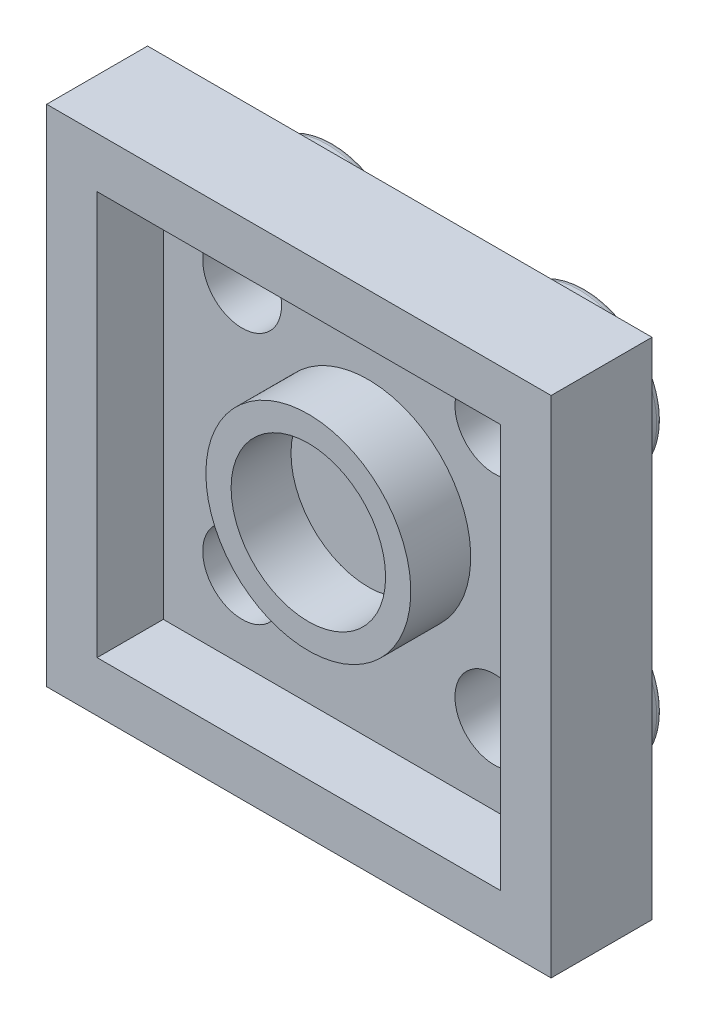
ISO-10303-21;
HEADER;
FILE_DESCRIPTION(('STEP AP214'),'2;1');
FILE_NAME('part.step','',(''),(''),'','','');
FILE_SCHEMA(('AUTOMOTIVE_DESIGN { 1 0 10303 214 1 1 1 1 }'));
ENDSEC;
DATA;
#1=APPLICATION_CONTEXT('core data for automotive mechanical design processes');
#2=APPLICATION_PROTOCOL_DEFINITION('international standard','automotive_design',2000,#1);
#3=PRODUCT_CONTEXT('',#1,'mechanical');
#4=PRODUCT('Part','Part','',(#3));
#5=PRODUCT_RELATED_PRODUCT_CATEGORY('part','',(#4));
#6=PRODUCT_DEFINITION_FORMATION('','',#4);
#7=PRODUCT_DEFINITION_CONTEXT('part definition',#1,'design');
#8=PRODUCT_DEFINITION('design','',#6,#7);
#9=PRODUCT_DEFINITION_SHAPE('','',#8);
#10=(LENGTH_UNIT() NAMED_UNIT(*) SI_UNIT(.MILLI.,.METRE.));
#11=(NAMED_UNIT(*) PLANE_ANGLE_UNIT() SI_UNIT($,.RADIAN.));
#12=(NAMED_UNIT(*) SI_UNIT($,.STERADIAN.) SOLID_ANGLE_UNIT());
#13=UNCERTAINTY_MEASURE_WITH_UNIT(LENGTH_MEASURE(1.E-05),#10,'distance_accuracy_value','');
#14=(GEOMETRIC_REPRESENTATION_CONTEXT(3) GLOBAL_UNCERTAINTY_ASSIGNED_CONTEXT((#13)) GLOBAL_UNIT_ASSIGNED_CONTEXT((#10,
#11,#12)) REPRESENTATION_CONTEXT('',''));
#15=CARTESIAN_POINT('',(0.,0.,0.));
#16=DIRECTION('',(0.,0.,1.));
#17=DIRECTION('',(1.,0.,0.));
#18=AXIS2_PLACEMENT_3D('',#15,#16,#17);
#19=CARTESIAN_POINT('',(0.,0.,0.));
#20=DIRECTION('',(0.,0.,-1.));
#21=DIRECTION('',(-1.,0.,0.));
#22=AXIS2_PLACEMENT_3D('',#19,#20,#21);
#23=PLANE('',#22);
#24=CARTESIAN_POINT('',(-4.,-12.,0.));
#25=DIRECTION('',(0.,0.,-1.));
#26=DIRECTION('',(-1.,0.,0.));
#27=AXIS2_PLACEMENT_3D('',#24,#25,#26);
#28=CIRCLE('',#27,2.45);
#29=CARTESIAN_POINT('',(-1.54999999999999,-12.,0.));
#30=VERTEX_POINT('',#29);
#31=EDGE_CURVE('E252',#30,#30,#28,.T.);
#32=ORIENTED_EDGE('',*,*,#31,.F.);
#33=EDGE_LOOP('',(#32));
#34=FACE_BOUND('',#33,.T.);
#35=CARTESIAN_POINT('',(-4.,-4.,0.));
#36=DIRECTION('',(0.,0.,-1.));
#37=DIRECTION('',(-1.,0.,0.));
#38=AXIS2_PLACEMENT_3D('',#35,#36,#37);
#39=CIRCLE('',#38,2.45);
#40=CARTESIAN_POINT('',(-1.55,-4.,0.));
#41=VERTEX_POINT('',#40);
#42=EDGE_CURVE('E269',#41,#41,#39,.T.);
#43=ORIENTED_EDGE('',*,*,#42,.F.);
#44=EDGE_LOOP('',(#43));
#45=FACE_BOUND('',#44,.T.);
#46=DIRECTION('',(0.,1.,0.));
#47=VECTOR('',#46,1.);
#48=CARTESIAN_POINT('',(0.,0.,0.));
#49=LINE('',#48,#47);
#50=CARTESIAN_POINT('',(0.,-16.,0.));
#51=VERTEX_POINT('',#50);
#52=CARTESIAN_POINT('',(0.,0.,0.));
#53=VERTEX_POINT('',#52);
#54=EDGE_CURVE('E129',#51,#53,#49,.T.);
#55=ORIENTED_EDGE('',*,*,#54,.F.);
#56=DIRECTION('',(1.,0.,0.));
#57=VECTOR('',#56,1.);
#58=CARTESIAN_POINT('',(0.,-16.,0.));
#59=LINE('',#58,#57);
#60=CARTESIAN_POINT('',(-16.,-16.,0.));
#61=VERTEX_POINT('',#60);
#62=EDGE_CURVE('E138',#61,#51,#59,.T.);
#63=ORIENTED_EDGE('',*,*,#62,.F.);
#64=DIRECTION('',(0.,-1.,0.));
#65=VECTOR('',#64,1.);
#66=CARTESIAN_POINT('',(-16.,0.,0.));
#67=LINE('',#66,#65);
#68=CARTESIAN_POINT('',(-16.,0.,0.));
#69=VERTEX_POINT('',#68);
#70=EDGE_CURVE('E136',#69,#61,#67,.T.);
#71=ORIENTED_EDGE('',*,*,#70,.F.);
#72=DIRECTION('',(-1.,0.,0.));
#73=VECTOR('',#72,1.);
#74=CARTESIAN_POINT('',(0.,0.,0.));
#75=LINE('',#74,#73);
#76=EDGE_CURVE('E134',#53,#69,#75,.T.);
#77=ORIENTED_EDGE('',*,*,#76,.F.);
#78=EDGE_LOOP('',(#55,#63,#71,#77));
#79=FACE_BOUND('',#78,.T.);
#80=CARTESIAN_POINT('',(-12.,-4.,0.));
#81=DIRECTION('',(0.,0.,-1.));
#82=DIRECTION('',(-1.,0.,0.));
#83=AXIS2_PLACEMENT_3D('',#80,#81,#82);
#84=CIRCLE('',#83,2.45);
#85=CARTESIAN_POINT('',(-9.55,-4.,0.));
#86=VERTEX_POINT('',#85);
#87=EDGE_CURVE('E247',#86,#86,#84,.T.);
#88=ORIENTED_EDGE('',*,*,#87,.F.);
#89=EDGE_LOOP('',(#88));
#90=FACE_BOUND('',#89,.T.);
#91=CARTESIAN_POINT('',(-12.,-12.,0.));
#92=DIRECTION('',(0.,0.,-1.));
#93=DIRECTION('',(-1.,0.,0.));
#94=AXIS2_PLACEMENT_3D('',#91,#92,#93);
#95=CIRCLE('',#94,2.45);
#96=CARTESIAN_POINT('',(-9.54999999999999,-12.,0.));
#97=VERTEX_POINT('',#96);
#98=EDGE_CURVE('E250',#97,#97,#95,.T.);
#99=ORIENTED_EDGE('',*,*,#98,.F.);
#100=EDGE_LOOP('',(#99));
#101=FACE_BOUND('',#100,.T.);
#102=ADVANCED_FACE('F26',(#34,#45,#79,#90,#101),#23,.T.);
#103=CARTESIAN_POINT('',(-1.6,-1.6,1.1));
#104=DIRECTION('',(0.,0.,1.));
#105=DIRECTION('',(1.,0.,0.));
#106=AXIS2_PLACEMENT_3D('',#103,#104,#105);
#107=PLANE('',#106);
#108=CARTESIAN_POINT('',(-11.9,-11.9,1.1));
#109=DIRECTION('',(0.,0.,1.));
#110=DIRECTION('',(1.,0.,0.));
#111=AXIS2_PLACEMENT_3D('',#108,#109,#110);
#112=CIRCLE('',#111,1.25);
#113=CARTESIAN_POINT('',(-10.65,-11.9,1.1));
#114=VERTEX_POINT('',#113);
#115=EDGE_CURVE('E475',#114,#114,#112,.T.);
#116=ORIENTED_EDGE('',*,*,#115,.F.);
#117=EDGE_LOOP('',(#116));
#118=FACE_BOUND('',#117,.T.);
#119=CARTESIAN_POINT('',(-3.9,-11.9,1.1));
#120=DIRECTION('',(0.,0.,1.));
#121=DIRECTION('',(1.,0.,0.));
#122=AXIS2_PLACEMENT_3D('',#119,#120,#121);
#123=CIRCLE('',#122,1.25);
#124=CARTESIAN_POINT('',(-2.65,-11.9,1.1));
#125=VERTEX_POINT('',#124);
#126=EDGE_CURVE('E474',#125,#125,#123,.T.);
#127=ORIENTED_EDGE('',*,*,#126,.F.);
#128=EDGE_LOOP('',(#127));
#129=FACE_BOUND('',#128,.T.);
#130=CARTESIAN_POINT('',(-11.9,-3.9,1.1));
#131=DIRECTION('',(0.,0.,1.));
#132=DIRECTION('',(1.,0.,0.));
#133=AXIS2_PLACEMENT_3D('',#130,#131,#132);
#134=CIRCLE('',#133,1.25);
#135=CARTESIAN_POINT('',(-10.65,-3.9,1.1));
#136=VERTEX_POINT('',#135);
#137=EDGE_CURVE('E258',#136,#136,#134,.T.);
#138=ORIENTED_EDGE('',*,*,#137,.F.);
#139=EDGE_LOOP('',(#138));
#140=FACE_BOUND('',#139,.T.);
#141=CARTESIAN_POINT('',(-3.9,-3.9,1.1));
#142=DIRECTION('',(0.,0.,1.));
#143=DIRECTION('',(1.,0.,0.));
#144=AXIS2_PLACEMENT_3D('',#141,#142,#143);
#145=CIRCLE('',#144,1.25);
#146=CARTESIAN_POINT('',(-2.65,-3.9,1.1));
#147=VERTEX_POINT('',#146);
#148=EDGE_CURVE('E263',#147,#147,#145,.T.);
#149=ORIENTED_EDGE('',*,*,#148,.F.);
#150=EDGE_LOOP('',(#149));
#151=FACE_BOUND('',#150,.T.);
#152=DIRECTION('',(0.,1.,0.));
#153=VECTOR('',#152,1.);
#154=CARTESIAN_POINT('',(-1.6,-14.4,1.1));
#155=LINE('',#154,#153);
#156=CARTESIAN_POINT('',(-1.6,-14.4,1.1));
#157=VERTEX_POINT('',#156);
#158=CARTESIAN_POINT('',(-1.6,-1.6,1.1));
#159=VERTEX_POINT('',#158);
#160=EDGE_CURVE('E115',#157,#159,#155,.T.);
#161=ORIENTED_EDGE('',*,*,#160,.T.);
#162=DIRECTION('',(-1.,0.,0.));
#163=VECTOR('',#162,1.);
#164=CARTESIAN_POINT('',(-1.6,-1.6,1.1));
#165=LINE('',#164,#163);
#166=CARTESIAN_POINT('',(-14.4,-1.6,1.1));
#167=VERTEX_POINT('',#166);
#168=EDGE_CURVE('E121',#159,#167,#165,.T.);
#169=ORIENTED_EDGE('',*,*,#168,.T.);
#170=DIRECTION('',(0.,-1.,0.));
#171=VECTOR('',#170,1.);
#172=CARTESIAN_POINT('',(-14.4,-14.4,1.1));
#173=LINE('',#172,#171);
#174=CARTESIAN_POINT('',(-14.4,-14.4,1.1));
#175=VERTEX_POINT('',#174);
#176=EDGE_CURVE('E99',#167,#175,#173,.T.);
#177=ORIENTED_EDGE('',*,*,#176,.T.);
#178=DIRECTION('',(1.,0.,0.));
#179=VECTOR('',#178,1.);
#180=CARTESIAN_POINT('',(-1.6,-14.4,1.1));
#181=LINE('',#180,#179);
#182=EDGE_CURVE('E124',#175,#157,#181,.T.);
#183=ORIENTED_EDGE('',*,*,#182,.T.);
#184=EDGE_LOOP('',(#161,#169,#177,#183));
#185=FACE_BOUND('',#184,.T.);
#186=CARTESIAN_POINT('',(-7.9,-7.80984541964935,1.1));
#187=DIRECTION('',(0.,0.,1.));
#188=DIRECTION('',(1.,0.,0.));
#189=AXIS2_PLACEMENT_3D('',#186,#187,#188);
#190=CIRCLE('',#189,3.25);
#191=CARTESIAN_POINT('',(-11.15,-7.80984541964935,1.1));
#192=VERTEX_POINT('',#191);
#193=EDGE_CURVE('E275',#192,#192,#190,.T.);
#194=ORIENTED_EDGE('',*,*,#193,.F.);
#195=EDGE_LOOP('',(#194));
#196=FACE_BOUND('',#195,.T.);
#197=ADVANCED_FACE('F202',(#118,#129,#140,#151,#185,#196),#107,.T.);
#198=CARTESIAN_POINT('',(0.,0.,3.2));
#199=DIRECTION('',(-1.,0.,0.));
#200=DIRECTION('',(0.,-1.,0.));
#201=AXIS2_PLACEMENT_3D('',#198,#199,#200);
#202=PLANE('',#201);
#203=ORIENTED_EDGE('',*,*,#54,.T.);
#204=DIRECTION('',(0.,0.,-1.));
#205=VECTOR('',#204,1.);
#206=CARTESIAN_POINT('',(0.,0.,3.2));
#207=LINE('',#206,#205);
#208=CARTESIAN_POINT('',(0.,0.,3.2));
#209=VERTEX_POINT('',#208);
#210=EDGE_CURVE('E156',#209,#53,#207,.T.);
#211=ORIENTED_EDGE('',*,*,#210,.F.);
#212=DIRECTION('',(0.,1.,0.));
#213=VECTOR('',#212,1.);
#214=CARTESIAN_POINT('',(0.,0.,3.2));
#215=LINE('',#214,#213);
#216=CARTESIAN_POINT('',(0.,-16.,3.2));
#217=VERTEX_POINT('',#216);
#218=EDGE_CURVE('E140',#217,#209,#215,.T.);
#219=ORIENTED_EDGE('',*,*,#218,.F.);
#220=DIRECTION('',(0.,0.,-1.));
#221=VECTOR('',#220,1.);
#222=CARTESIAN_POINT('',(0.,-16.,3.2));
#223=LINE('',#222,#221);
#224=EDGE_CURVE('E147',#217,#51,#223,.T.);
#225=ORIENTED_EDGE('',*,*,#224,.T.);
#226=EDGE_LOOP('',(#203,#211,#219,#225));
#227=FACE_BOUND('',#226,.T.);
#228=ADVANCED_FACE('F28',(#227),#202,.F.);
#229=CARTESIAN_POINT('',(0.,0.,3.2));
#230=DIRECTION('',(0.,-1.,0.));
#231=DIRECTION('',(1.,0.,0.));
#232=AXIS2_PLACEMENT_3D('',#229,#230,#231);
#233=PLANE('',#232);
#234=ORIENTED_EDGE('',*,*,#76,.T.);
#235=DIRECTION('',(0.,0.,-1.));
#236=VECTOR('',#235,1.);
#237=CARTESIAN_POINT('',(-16.,0.,3.2));
#238=LINE('',#237,#236);
#239=CARTESIAN_POINT('',(-16.,0.,3.2));
#240=VERTEX_POINT('',#239);
#241=EDGE_CURVE('E153',#240,#69,#238,.T.);
#242=ORIENTED_EDGE('',*,*,#241,.F.);
#243=DIRECTION('',(-1.,0.,0.));
#244=VECTOR('',#243,1.);
#245=CARTESIAN_POINT('',(0.,0.,3.2));
#246=LINE('',#245,#244);
#247=EDGE_CURVE('E142',#209,#240,#246,.T.);
#248=ORIENTED_EDGE('',*,*,#247,.F.);
#249=ORIENTED_EDGE('',*,*,#210,.T.);
#250=EDGE_LOOP('',(#234,#242,#248,#249));
#251=FACE_BOUND('',#250,.T.);
#252=ADVANCED_FACE('F226',(#251),#233,.F.);
#253=CARTESIAN_POINT('',(-16.,0.,3.2));
#254=DIRECTION('',(1.,0.,0.));
#255=DIRECTION('',(0.,1.,0.));
#256=AXIS2_PLACEMENT_3D('',#253,#254,#255);
#257=PLANE('',#256);
#258=ORIENTED_EDGE('',*,*,#70,.T.);
#259=DIRECTION('',(0.,0.,-1.));
#260=VECTOR('',#259,1.);
#261=CARTESIAN_POINT('',(-16.,-16.,3.2));
#262=LINE('',#261,#260);
#263=CARTESIAN_POINT('',(-16.,-16.,3.2));
#264=VERTEX_POINT('',#263);
#265=EDGE_CURVE('E150',#264,#61,#262,.T.);
#266=ORIENTED_EDGE('',*,*,#265,.F.);
#267=DIRECTION('',(0.,-1.,0.));
#268=VECTOR('',#267,1.);
#269=CARTESIAN_POINT('',(-16.,0.,3.2));
#270=LINE('',#269,#268);
#271=EDGE_CURVE('E144',#240,#264,#270,.T.);
#272=ORIENTED_EDGE('',*,*,#271,.F.);
#273=ORIENTED_EDGE('',*,*,#241,.T.);
#274=EDGE_LOOP('',(#258,#266,#272,#273));
#275=FACE_BOUND('',#274,.T.);
#276=ADVANCED_FACE('F223',(#275),#257,.F.);
#277=CARTESIAN_POINT('',(0.,-16.,3.2));
#278=DIRECTION('',(0.,1.,0.));
#279=DIRECTION('',(-1.,0.,0.));
#280=AXIS2_PLACEMENT_3D('',#277,#278,#279);
#281=PLANE('',#280);
#282=ORIENTED_EDGE('',*,*,#62,.T.);
#283=ORIENTED_EDGE('',*,*,#224,.F.);
#284=DIRECTION('',(1.,0.,0.));
#285=VECTOR('',#284,1.);
#286=CARTESIAN_POINT('',(0.,-16.,3.2));
#287=LINE('',#286,#285);
#288=EDGE_CURVE('E49',#264,#217,#287,.T.);
#289=ORIENTED_EDGE('',*,*,#288,.F.);
#290=ORIENTED_EDGE('',*,*,#265,.T.);
#291=EDGE_LOOP('',(#282,#283,#289,#290));
#292=FACE_BOUND('',#291,.T.);
#293=ADVANCED_FACE('F220',(#292),#281,.F.);
#294=CARTESIAN_POINT('',(0.,0.,3.2));
#295=DIRECTION('',(0.,0.,-1.));
#296=DIRECTION('',(-1.,0.,0.));
#297=AXIS2_PLACEMENT_3D('',#294,#295,#296);
#298=PLANE('',#297);
#299=DIRECTION('',(-1.,0.,0.));
#300=VECTOR('',#299,1.);
#301=CARTESIAN_POINT('',(-1.6,-1.6,3.2));
#302=LINE('',#301,#300);
#303=CARTESIAN_POINT('',(-1.6,-1.6,3.2));
#304=VERTEX_POINT('',#303);
#305=CARTESIAN_POINT('',(-14.4,-1.6,3.2));
#306=VERTEX_POINT('',#305);
#307=EDGE_CURVE('E107',#304,#306,#302,.T.);
#308=ORIENTED_EDGE('',*,*,#307,.F.);
#309=DIRECTION('',(0.,1.,0.));
#310=VECTOR('',#309,1.);
#311=CARTESIAN_POINT('',(-1.6,-14.4,3.2));
#312=LINE('',#311,#310);
#313=CARTESIAN_POINT('',(-1.6,-14.4,3.2));
#314=VERTEX_POINT('',#313);
#315=EDGE_CURVE('E41',#314,#304,#312,.T.);
#316=ORIENTED_EDGE('',*,*,#315,.F.);
#317=DIRECTION('',(1.,0.,0.));
#318=VECTOR('',#317,1.);
#319=CARTESIAN_POINT('',(-1.6,-14.4,3.2));
#320=LINE('',#319,#318);
#321=CARTESIAN_POINT('',(-14.4,-14.4,3.2));
#322=VERTEX_POINT('',#321);
#323=EDGE_CURVE('E113',#322,#314,#320,.T.);
#324=ORIENTED_EDGE('',*,*,#323,.F.);
#325=DIRECTION('',(0.,-1.,0.));
#326=VECTOR('',#325,1.);
#327=CARTESIAN_POINT('',(-14.4,-14.4,3.2));
#328=LINE('',#327,#326);
#329=EDGE_CURVE('E96',#306,#322,#328,.T.);
#330=ORIENTED_EDGE('',*,*,#329,.F.);
#331=EDGE_LOOP('',(#308,#316,#324,#330));
#332=FACE_BOUND('',#331,.T.);
#333=ORIENTED_EDGE('',*,*,#218,.T.);
#334=ORIENTED_EDGE('',*,*,#247,.T.);
#335=ORIENTED_EDGE('',*,*,#271,.T.);
#336=ORIENTED_EDGE('',*,*,#288,.T.);
#337=EDGE_LOOP('',(#333,#334,#335,#336));
#338=FACE_BOUND('',#337,.T.);
#339=ADVANCED_FACE('F111',(#332,#338),#298,.F.);
#340=CARTESIAN_POINT('',(-1.6,-14.4,1.1));
#341=DIRECTION('',(1.,0.,0.));
#342=DIRECTION('',(0.,0.,-1.));
#343=AXIS2_PLACEMENT_3D('',#340,#341,#342);
#344=PLANE('',#343);
#345=ORIENTED_EDGE('',*,*,#315,.T.);
#346=DIRECTION('',(0.,0.,1.));
#347=VECTOR('',#346,1.);
#348=CARTESIAN_POINT('',(-1.6,-1.6,1.1));
#349=LINE('',#348,#347);
#350=EDGE_CURVE('E104',#159,#304,#349,.T.);
#351=ORIENTED_EDGE('',*,*,#350,.F.);
#352=ORIENTED_EDGE('',*,*,#160,.F.);
#353=DIRECTION('',(0.,0.,1.));
#354=VECTOR('',#353,1.);
#355=CARTESIAN_POINT('',(-1.6,-14.4,1.1));
#356=LINE('',#355,#354);
#357=EDGE_CURVE('E127',#157,#314,#356,.T.);
#358=ORIENTED_EDGE('',*,*,#357,.T.);
#359=EDGE_LOOP('',(#345,#351,#352,#358));
#360=FACE_BOUND('',#359,.T.);
#361=ADVANCED_FACE('F216',(#360),#344,.F.);
#362=CARTESIAN_POINT('',(-1.6,-14.4,1.1));
#363=DIRECTION('',(0.,-1.,0.));
#364=DIRECTION('',(1.,0.,0.));
#365=AXIS2_PLACEMENT_3D('',#362,#363,#364);
#366=PLANE('',#365);
#367=ORIENTED_EDGE('',*,*,#323,.T.);
#368=ORIENTED_EDGE('',*,*,#357,.F.);
#369=ORIENTED_EDGE('',*,*,#182,.F.);
#370=DIRECTION('',(0.,0.,1.));
#371=VECTOR('',#370,1.);
#372=CARTESIAN_POINT('',(-14.4,-14.4,1.1));
#373=LINE('',#372,#371);
#374=EDGE_CURVE('E103',#175,#322,#373,.T.);
#375=ORIENTED_EDGE('',*,*,#374,.T.);
#376=EDGE_LOOP('',(#367,#368,#369,#375));
#377=FACE_BOUND('',#376,.T.);
#378=ADVANCED_FACE('F303',(#377),#366,.F.);
#379=CARTESIAN_POINT('',(-14.4,-14.4,1.1));
#380=DIRECTION('',(-1.,0.,0.));
#381=DIRECTION('',(0.,0.,1.));
#382=AXIS2_PLACEMENT_3D('',#379,#380,#381);
#383=PLANE('',#382);
#384=ORIENTED_EDGE('',*,*,#329,.T.);
#385=ORIENTED_EDGE('',*,*,#374,.F.);
#386=ORIENTED_EDGE('',*,*,#176,.F.);
#387=DIRECTION('',(0.,0.,1.));
#388=VECTOR('',#387,1.);
#389=CARTESIAN_POINT('',(-14.4,-1.6,1.1));
#390=LINE('',#389,#388);
#391=EDGE_CURVE('E92',#167,#306,#390,.T.);
#392=ORIENTED_EDGE('',*,*,#391,.T.);
#393=EDGE_LOOP('',(#384,#385,#386,#392));
#394=FACE_BOUND('',#393,.T.);
#395=ADVANCED_FACE('F94',(#394),#383,.F.);
#396=CARTESIAN_POINT('',(-1.6,-1.6,1.1));
#397=DIRECTION('',(0.,1.,0.));
#398=DIRECTION('',(-1.,0.,0.));
#399=AXIS2_PLACEMENT_3D('',#396,#397,#398);
#400=PLANE('',#399);
#401=ORIENTED_EDGE('',*,*,#307,.T.);
#402=ORIENTED_EDGE('',*,*,#391,.F.);
#403=ORIENTED_EDGE('',*,*,#168,.F.);
#404=ORIENTED_EDGE('',*,*,#350,.T.);
#405=EDGE_LOOP('',(#401,#402,#403,#404));
#406=FACE_BOUND('',#405,.T.);
#407=ADVANCED_FACE('F108',(#406),#400,.F.);
#408=CARTESIAN_POINT('',(-7.9,-7.80984541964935,3.));
#409=DIRECTION('',(0.,0.,1.));
#410=DIRECTION('',(1.,0.,0.));
#411=AXIS2_PLACEMENT_3D('',#408,#409,#410);
#412=PLANE('',#411);
#413=CARTESIAN_POINT('',(-7.9,-7.80984541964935,3.));
#414=DIRECTION('',(0.,0.,1.));
#415=DIRECTION('',(1.,0.,0.));
#416=AXIS2_PLACEMENT_3D('',#413,#414,#415);
#417=CIRCLE('',#416,3.25);
#418=CARTESIAN_POINT('',(-11.15,-7.80984541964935,3.));
#419=VERTEX_POINT('',#418);
#420=EDGE_CURVE('E278',#419,#419,#417,.T.);
#421=ORIENTED_EDGE('',*,*,#420,.T.);
#422=EDGE_LOOP('',(#421));
#423=FACE_BOUND('',#422,.T.);
#424=CARTESIAN_POINT('',(-7.9,-7.80984541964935,3.));
#425=DIRECTION('',(0.,0.,1.));
#426=DIRECTION('',(1.,0.,0.));
#427=AXIS2_PLACEMENT_3D('',#424,#425,#426);
#428=CIRCLE('',#427,2.45);
#429=CARTESIAN_POINT('',(-10.35,-7.80984541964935,3.));
#430=VERTEX_POINT('',#429);
#431=EDGE_CURVE('E272',#430,#430,#428,.T.);
#432=ORIENTED_EDGE('',*,*,#431,.F.);
#433=EDGE_LOOP('',(#432));
#434=FACE_BOUND('',#433,.T.);
#435=ADVANCED_FACE('F282',(#423,#434),#412,.T.);
#436=CARTESIAN_POINT('',(-7.9,-7.80984541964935,3.));
#437=DIRECTION('',(0.,0.,-1.));
#438=DIRECTION('',(-1.,0.,0.));
#439=AXIS2_PLACEMENT_3D('',#436,#437,#438);
#440=CYLINDRICAL_SURFACE('',#439,3.25);
#441=CARTESIAN_POINT('',(-11.15,-7.80984541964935,3.));
#442=CARTESIAN_POINT('',(-11.15,-7.80984541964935,2.98020833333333));
#443=CARTESIAN_POINT('',(-11.15,-7.80984541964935,2.96041666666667));
#444=CARTESIAN_POINT('',(-11.15,-7.80984541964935,2.92083333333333));
#445=CARTESIAN_POINT('',(-11.15,-7.80984541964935,2.90104166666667));
#446=CARTESIAN_POINT('',(-11.15,-7.80984541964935,2.86145833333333));
#447=CARTESIAN_POINT('',(-11.15,-7.80984541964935,2.84166666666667));
#448=CARTESIAN_POINT('',(-11.15,-7.80984541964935,2.80208333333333));
#449=CARTESIAN_POINT('',(-11.15,-7.80984541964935,2.78229166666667));
#450=CARTESIAN_POINT('',(-11.15,-7.80984541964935,2.74270833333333));
#451=CARTESIAN_POINT('',(-11.15,-7.80984541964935,2.72291666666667));
#452=CARTESIAN_POINT('',(-11.15,-7.80984541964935,2.68333333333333));
#453=CARTESIAN_POINT('',(-11.15,-7.80984541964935,2.66354166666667));
#454=CARTESIAN_POINT('',(-11.15,-7.80984541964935,2.62395833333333));
#455=CARTESIAN_POINT('',(-11.15,-7.80984541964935,2.60416666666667));
#456=CARTESIAN_POINT('',(-11.15,-7.80984541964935,2.56458333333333));
#457=CARTESIAN_POINT('',(-11.15,-7.80984541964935,2.54479166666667));
#458=CARTESIAN_POINT('',(-11.15,-7.80984541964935,2.50520833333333));
#459=CARTESIAN_POINT('',(-11.15,-7.80984541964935,2.48541666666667));
#460=CARTESIAN_POINT('',(-11.15,-7.80984541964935,2.44583333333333));
#461=CARTESIAN_POINT('',(-11.15,-7.80984541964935,2.42604166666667));
#462=CARTESIAN_POINT('',(-11.15,-7.80984541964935,2.38645833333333));
#463=CARTESIAN_POINT('',(-11.15,-7.80984541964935,2.36666666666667));
#464=CARTESIAN_POINT('',(-11.15,-7.80984541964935,2.32708333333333));
#465=CARTESIAN_POINT('',(-11.15,-7.80984541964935,2.30729166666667));
#466=CARTESIAN_POINT('',(-11.15,-7.80984541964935,2.26770833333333));
#467=CARTESIAN_POINT('',(-11.15,-7.80984541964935,2.24791666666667));
#468=CARTESIAN_POINT('',(-11.15,-7.80984541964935,2.20833333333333));
#469=CARTESIAN_POINT('',(-11.15,-7.80984541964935,2.18854166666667));
#470=CARTESIAN_POINT('',(-11.15,-7.80984541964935,2.14895833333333));
#471=CARTESIAN_POINT('',(-11.15,-7.80984541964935,2.12916666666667));
#472=CARTESIAN_POINT('',(-11.15,-7.80984541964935,2.08958333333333));
#473=CARTESIAN_POINT('',(-11.15,-7.80984541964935,2.06979166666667));
#474=CARTESIAN_POINT('',(-11.15,-7.80984541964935,2.03020833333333));
#475=CARTESIAN_POINT('',(-11.15,-7.80984541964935,2.01041666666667));
#476=CARTESIAN_POINT('',(-11.15,-7.80984541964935,1.97083333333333));
#477=CARTESIAN_POINT('',(-11.15,-7.80984541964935,1.95104166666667));
#478=CARTESIAN_POINT('',(-11.15,-7.80984541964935,1.91145833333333));
#479=CARTESIAN_POINT('',(-11.15,-7.80984541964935,1.89166666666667));
#480=CARTESIAN_POINT('',(-11.15,-7.80984541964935,1.85208333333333));
#481=CARTESIAN_POINT('',(-11.15,-7.80984541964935,1.83229166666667));
#482=CARTESIAN_POINT('',(-11.15,-7.80984541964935,1.79270833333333));
#483=CARTESIAN_POINT('',(-11.15,-7.80984541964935,1.77291666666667));
#484=CARTESIAN_POINT('',(-11.15,-7.80984541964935,1.73333333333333));
#485=CARTESIAN_POINT('',(-11.15,-7.80984541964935,1.71354166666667));
#486=CARTESIAN_POINT('',(-11.15,-7.80984541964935,1.67395833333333));
#487=CARTESIAN_POINT('',(-11.15,-7.80984541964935,1.65416666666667));
#488=CARTESIAN_POINT('',(-11.15,-7.80984541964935,1.61458333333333));
#489=CARTESIAN_POINT('',(-11.15,-7.80984541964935,1.59479166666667));
#490=CARTESIAN_POINT('',(-11.15,-7.80984541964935,1.55520833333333));
#491=CARTESIAN_POINT('',(-11.15,-7.80984541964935,1.53541666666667));
#492=CARTESIAN_POINT('',(-11.15,-7.80984541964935,1.49583333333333));
#493=CARTESIAN_POINT('',(-11.15,-7.80984541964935,1.47604166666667));
#494=CARTESIAN_POINT('',(-11.15,-7.80984541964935,1.43645833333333));
#495=CARTESIAN_POINT('',(-11.15,-7.80984541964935,1.41666666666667));
#496=CARTESIAN_POINT('',(-11.15,-7.80984541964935,1.37708333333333));
#497=CARTESIAN_POINT('',(-11.15,-7.80984541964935,1.35729166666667));
#498=CARTESIAN_POINT('',(-11.15,-7.80984541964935,1.31770833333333));
#499=CARTESIAN_POINT('',(-11.15,-7.80984541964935,1.29791666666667));
#500=CARTESIAN_POINT('',(-11.15,-7.80984541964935,1.25833333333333));
#501=CARTESIAN_POINT('',(-11.15,-7.80984541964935,1.23854166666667));
#502=CARTESIAN_POINT('',(-11.15,-7.80984541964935,1.19895833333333));
#503=CARTESIAN_POINT('',(-11.15,-7.80984541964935,1.17916666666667));
#504=CARTESIAN_POINT('',(-11.15,-7.80984541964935,1.13958333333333));
#505=CARTESIAN_POINT('',(-11.15,-7.80984541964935,1.11979166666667));
#506=CARTESIAN_POINT('',(-11.15,-7.80984541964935,1.1));
#507=B_SPLINE_CURVE_WITH_KNOTS('',3,(#441,#442,#443,#444,#445,#446,#447,#448,#449,#450,#451,
#452,#453,#454,#455,#456,#457,#458,#459,#460,#461,#462,#463,#464,#465,#466,#467,#468,#469,#470,
#471,#472,#473,#474,#475,#476,#477,#478,#479,#480,#481,#482,#483,#484,#485,#486,#487,#488,#489,
#490,#491,#492,#493,#494,#495,#496,#497,#498,#499,#500,#501,#502,#503,#504,#505,#506),
.UNSPECIFIED.,.F.,.F.,(4,2,2,2,2,2,2,2,2,2,2,2,2,2,2,2,2,2,2,2,2,2,2,2,2,2,2,2,2,2,2,2,4),(0.,
0.059375,0.11875,0.178125,0.2375,0.296875,0.35625,0.415625,0.475,0.534375,0.59375,0.653125,
0.7125,0.771875,0.83125,0.890625,0.95,1.009375,1.06875,1.128125,1.1875,1.246875,1.30625,
1.365625,1.425,1.484375,1.54375,1.603125,1.6625,1.721875,1.78125,1.840625,1.9),.UNSPECIFIED.);
#508=EDGE_CURVE('BSEAM285',#419,#192,#507,.T.);
#509=ORIENTED_EDGE('',*,*,#420,.F.);
#510=ORIENTED_EDGE('',*,*,#193,.T.);
#511=ORIENTED_EDGE('',*,*,#508,.T.);
#512=ORIENTED_EDGE('',*,*,#508,.F.);
#513=EDGE_LOOP('',(#509,#511,#510,#512));
#514=FACE_BOUND('',#513,.T.);
#515=ADVANCED_FACE('F285',(#514),#440,.T.);
#516=CARTESIAN_POINT('',(-7.9,-7.80984541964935,3.));
#517=DIRECTION('',(0.,0.,-1.));
#518=DIRECTION('',(-1.,0.,0.));
#519=AXIS2_PLACEMENT_3D('',#516,#517,#518);
#520=CYLINDRICAL_SURFACE('',#519,2.45);
#521=CARTESIAN_POINT('',(-7.9,-7.80984541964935,1.1));
#522=DIRECTION('',(0.,0.,1.));
#523=DIRECTION('',(1.,0.,0.));
#524=AXIS2_PLACEMENT_3D('',#521,#522,#523);
#525=CIRCLE('',#524,2.45);
#526=CARTESIAN_POINT('',(-10.35,-7.80984541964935,1.1));
#527=VERTEX_POINT('',#526);
#528=EDGE_CURVE('E159',#527,#527,#525,.F.);
#529=CARTESIAN_POINT('',(-10.35,-7.80984541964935,3.));
#530=CARTESIAN_POINT('',(-10.35,-7.80984541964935,2.98020833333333));
#531=CARTESIAN_POINT('',(-10.35,-7.80984541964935,2.96041666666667));
#532=CARTESIAN_POINT('',(-10.35,-7.80984541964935,2.92083333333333));
#533=CARTESIAN_POINT('',(-10.35,-7.80984541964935,2.90104166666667));
#534=CARTESIAN_POINT('',(-10.35,-7.80984541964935,2.86145833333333));
#535=CARTESIAN_POINT('',(-10.35,-7.80984541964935,2.84166666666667));
#536=CARTESIAN_POINT('',(-10.35,-7.80984541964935,2.80208333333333));
#537=CARTESIAN_POINT('',(-10.35,-7.80984541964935,2.78229166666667));
#538=CARTESIAN_POINT('',(-10.35,-7.80984541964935,2.74270833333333));
#539=CARTESIAN_POINT('',(-10.35,-7.80984541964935,2.72291666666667));
#540=CARTESIAN_POINT('',(-10.35,-7.80984541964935,2.68333333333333));
#541=CARTESIAN_POINT('',(-10.35,-7.80984541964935,2.66354166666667));
#542=CARTESIAN_POINT('',(-10.35,-7.80984541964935,2.62395833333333));
#543=CARTESIAN_POINT('',(-10.35,-7.80984541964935,2.60416666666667));
#544=CARTESIAN_POINT('',(-10.35,-7.80984541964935,2.56458333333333));
#545=CARTESIAN_POINT('',(-10.35,-7.80984541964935,2.54479166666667));
#546=CARTESIAN_POINT('',(-10.35,-7.80984541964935,2.50520833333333));
#547=CARTESIAN_POINT('',(-10.35,-7.80984541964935,2.48541666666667));
#548=CARTESIAN_POINT('',(-10.35,-7.80984541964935,2.44583333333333));
#549=CARTESIAN_POINT('',(-10.35,-7.80984541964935,2.42604166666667));
#550=CARTESIAN_POINT('',(-10.35,-7.80984541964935,2.38645833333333));
#551=CARTESIAN_POINT('',(-10.35,-7.80984541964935,2.36666666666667));
#552=CARTESIAN_POINT('',(-10.35,-7.80984541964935,2.32708333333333));
#553=CARTESIAN_POINT('',(-10.35,-7.80984541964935,2.30729166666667));
#554=CARTESIAN_POINT('',(-10.35,-7.80984541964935,2.26770833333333));
#555=CARTESIAN_POINT('',(-10.35,-7.80984541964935,2.24791666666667));
#556=CARTESIAN_POINT('',(-10.35,-7.80984541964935,2.20833333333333));
#557=CARTESIAN_POINT('',(-10.35,-7.80984541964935,2.18854166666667));
#558=CARTESIAN_POINT('',(-10.35,-7.80984541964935,2.14895833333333));
#559=CARTESIAN_POINT('',(-10.35,-7.80984541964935,2.12916666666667));
#560=CARTESIAN_POINT('',(-10.35,-7.80984541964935,2.08958333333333));
#561=CARTESIAN_POINT('',(-10.35,-7.80984541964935,2.06979166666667));
#562=CARTESIAN_POINT('',(-10.35,-7.80984541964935,2.03020833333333));
#563=CARTESIAN_POINT('',(-10.35,-7.80984541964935,2.01041666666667));
#564=CARTESIAN_POINT('',(-10.35,-7.80984541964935,1.97083333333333));
#565=CARTESIAN_POINT('',(-10.35,-7.80984541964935,1.95104166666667));
#566=CARTESIAN_POINT('',(-10.35,-7.80984541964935,1.91145833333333));
#567=CARTESIAN_POINT('',(-10.35,-7.80984541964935,1.89166666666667));
#568=CARTESIAN_POINT('',(-10.35,-7.80984541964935,1.85208333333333));
#569=CARTESIAN_POINT('',(-10.35,-7.80984541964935,1.83229166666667));
#570=CARTESIAN_POINT('',(-10.35,-7.80984541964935,1.79270833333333));
#571=CARTESIAN_POINT('',(-10.35,-7.80984541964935,1.77291666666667));
#572=CARTESIAN_POINT('',(-10.35,-7.80984541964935,1.73333333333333));
#573=CARTESIAN_POINT('',(-10.35,-7.80984541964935,1.71354166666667));
#574=CARTESIAN_POINT('',(-10.35,-7.80984541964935,1.67395833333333));
#575=CARTESIAN_POINT('',(-10.35,-7.80984541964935,1.65416666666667));
#576=CARTESIAN_POINT('',(-10.35,-7.80984541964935,1.61458333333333));
#577=CARTESIAN_POINT('',(-10.35,-7.80984541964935,1.59479166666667));
#578=CARTESIAN_POINT('',(-10.35,-7.80984541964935,1.55520833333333));
#579=CARTESIAN_POINT('',(-10.35,-7.80984541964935,1.53541666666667));
#580=CARTESIAN_POINT('',(-10.35,-7.80984541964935,1.49583333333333));
#581=CARTESIAN_POINT('',(-10.35,-7.80984541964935,1.47604166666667));
#582=CARTESIAN_POINT('',(-10.35,-7.80984541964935,1.43645833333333));
#583=CARTESIAN_POINT('',(-10.35,-7.80984541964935,1.41666666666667));
#584=CARTESIAN_POINT('',(-10.35,-7.80984541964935,1.37708333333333));
#585=CARTESIAN_POINT('',(-10.35,-7.80984541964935,1.35729166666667));
#586=CARTESIAN_POINT('',(-10.35,-7.80984541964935,1.31770833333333));
#587=CARTESIAN_POINT('',(-10.35,-7.80984541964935,1.29791666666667));
#588=CARTESIAN_POINT('',(-10.35,-7.80984541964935,1.25833333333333));
#589=CARTESIAN_POINT('',(-10.35,-7.80984541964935,1.23854166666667));
#590=CARTESIAN_POINT('',(-10.35,-7.80984541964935,1.19895833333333));
#591=CARTESIAN_POINT('',(-10.35,-7.80984541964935,1.17916666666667));
#592=CARTESIAN_POINT('',(-10.35,-7.80984541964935,1.13958333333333));
#593=CARTESIAN_POINT('',(-10.35,-7.80984541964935,1.11979166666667));
#594=CARTESIAN_POINT('',(-10.35,-7.80984541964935,1.1));
#595=B_SPLINE_CURVE_WITH_KNOTS('',3,(#529,#530,#531,#532,#533,#534,#535,#536,#537,#538,#539,
#540,#541,#542,#543,#544,#545,#546,#547,#548,#549,#550,#551,#552,#553,#554,#555,#556,#557,#558,
#559,#560,#561,#562,#563,#564,#565,#566,#567,#568,#569,#570,#571,#572,#573,#574,#575,#576,#577,
#578,#579,#580,#581,#582,#583,#584,#585,#586,#587,#588,#589,#590,#591,#592,#593,#594),
.UNSPECIFIED.,.F.,.F.,(4,2,2,2,2,2,2,2,2,2,2,2,2,2,2,2,2,2,2,2,2,2,2,2,2,2,2,2,2,2,2,2,4),(0.,
0.0593750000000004,0.11875,0.178125,0.2375,0.296875,0.35625,0.415625,0.475,0.534375,0.59375,
0.653125,0.7125,0.771875,0.83125,0.890625,0.95,1.009375,1.06875,1.128125,1.1875,1.246875,
1.30625,1.365625,1.425,1.484375,1.54375,1.603125,1.6625,1.721875,1.78125,1.840625,1.9),.UNSPECIFIED.);
#596=EDGE_CURVE('BSEAM288',#430,#527,#595,.T.);
#597=ORIENTED_EDGE('',*,*,#431,.T.);
#598=ORIENTED_EDGE('',*,*,#528,.T.);
#599=ORIENTED_EDGE('',*,*,#596,.T.);
#600=ORIENTED_EDGE('',*,*,#596,.F.);
#601=EDGE_LOOP('',(#597,#599,#598,#600));
#602=FACE_BOUND('',#601,.T.);
#603=ADVANCED_FACE('F288',(#602),#520,.F.);
#604=ORIENTED_EDGE('',*,*,#528,.F.);
#605=EDGE_LOOP('',(#604));
#606=FACE_BOUND('',#605,.T.);
#607=ADVANCED_FACE('F211',(#606),#107,.T.);
#608=CARTESIAN_POINT('',(-4.,-4.,-1.9));
#609=DIRECTION('',(0.,0.,1.));
#610=DIRECTION('',(1.,0.,0.));
#611=AXIS2_PLACEMENT_3D('',#608,#609,#610);
#612=CYLINDRICAL_SURFACE('',#611,2.45);
#613=CARTESIAN_POINT('',(-4.,-4.,-1.7));
#614=DIRECTION('',(0.,0.,-1.));
#615=DIRECTION('',(-1.,0.,0.));
#616=AXIS2_PLACEMENT_3D('',#613,#614,#615);
#617=CIRCLE('',#616,2.45);
#618=CARTESIAN_POINT('',(-1.55,-4.,-1.7));
#619=VERTEX_POINT('',#618);
#620=EDGE_CURVE('E165',#619,#619,#617,.F.);
#621=CARTESIAN_POINT('',(-1.55,-4.,-1.7));
#622=CARTESIAN_POINT('',(-1.55,-4.,-1.68229166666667));
#623=CARTESIAN_POINT('',(-1.55,-4.,-1.66458333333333));
#624=CARTESIAN_POINT('',(-1.55,-4.,-1.62916666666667));
#625=CARTESIAN_POINT('',(-1.55,-4.,-1.61145833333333));
#626=CARTESIAN_POINT('',(-1.55,-4.,-1.57604166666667));
#627=CARTESIAN_POINT('',(-1.55,-4.,-1.55833333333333));
#628=CARTESIAN_POINT('',(-1.55,-4.,-1.52291666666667));
#629=CARTESIAN_POINT('',(-1.55,-4.,-1.50520833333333));
#630=CARTESIAN_POINT('',(-1.55,-4.,-1.46979166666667));
#631=CARTESIAN_POINT('',(-1.55,-4.,-1.45208333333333));
#632=CARTESIAN_POINT('',(-1.55,-4.,-1.41666666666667));
#633=CARTESIAN_POINT('',(-1.55,-4.,-1.39895833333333));
#634=CARTESIAN_POINT('',(-1.55,-4.,-1.36354166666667));
#635=CARTESIAN_POINT('',(-1.55,-4.,-1.34583333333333));
#636=CARTESIAN_POINT('',(-1.55,-4.,-1.31041666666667));
#637=CARTESIAN_POINT('',(-1.55,-4.,-1.29270833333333));
#638=CARTESIAN_POINT('',(-1.55,-4.,-1.25729166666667));
#639=CARTESIAN_POINT('',(-1.55,-4.,-1.23958333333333));
#640=CARTESIAN_POINT('',(-1.55,-4.,-1.20416666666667));
#641=CARTESIAN_POINT('',(-1.55,-4.,-1.18645833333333));
#642=CARTESIAN_POINT('',(-1.55,-4.,-1.15104166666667));
#643=CARTESIAN_POINT('',(-1.55,-4.,-1.13333333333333));
#644=CARTESIAN_POINT('',(-1.55,-4.,-1.09791666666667));
#645=CARTESIAN_POINT('',(-1.55,-4.,-1.08020833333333));
#646=CARTESIAN_POINT('',(-1.55,-4.,-1.04479166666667));
#647=CARTESIAN_POINT('',(-1.55,-4.,-1.02708333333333));
#648=CARTESIAN_POINT('',(-1.55,-4.,-0.991666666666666));
#649=CARTESIAN_POINT('',(-1.55,-4.,-0.973958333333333));
#650=CARTESIAN_POINT('',(-1.55,-4.,-0.938541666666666));
#651=CARTESIAN_POINT('',(-1.55,-4.,-0.920833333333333));
#652=CARTESIAN_POINT('',(-1.55,-4.,-0.885416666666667));
#653=CARTESIAN_POINT('',(-1.55,-4.,-0.867708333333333));
#654=CARTESIAN_POINT('',(-1.55,-4.,-0.832291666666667));
#655=CARTESIAN_POINT('',(-1.55,-4.,-0.814583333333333));
#656=CARTESIAN_POINT('',(-1.55,-4.,-0.779166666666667));
#657=CARTESIAN_POINT('',(-1.55,-4.,-0.761458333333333));
#658=CARTESIAN_POINT('',(-1.55,-4.,-0.726041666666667));
#659=CARTESIAN_POINT('',(-1.55,-4.,-0.708333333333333));
#660=CARTESIAN_POINT('',(-1.55,-4.,-0.672916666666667));
#661=CARTESIAN_POINT('',(-1.55,-4.,-0.655208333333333));
#662=CARTESIAN_POINT('',(-1.55,-4.,-0.619791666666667));
#663=CARTESIAN_POINT('',(-1.55,-4.,-0.602083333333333));
#664=CARTESIAN_POINT('',(-1.55,-4.,-0.566666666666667));
#665=CARTESIAN_POINT('',(-1.55,-4.,-0.548958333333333));
#666=CARTESIAN_POINT('',(-1.55,-4.,-0.513541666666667));
#667=CARTESIAN_POINT('',(-1.55,-4.,-0.495833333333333));
#668=CARTESIAN_POINT('',(-1.55,-4.,-0.460416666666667));
#669=CARTESIAN_POINT('',(-1.55,-4.,-0.442708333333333));
#670=CARTESIAN_POINT('',(-1.55,-4.,-0.407291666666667));
#671=CARTESIAN_POINT('',(-1.55,-4.,-0.389583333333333));
#672=CARTESIAN_POINT('',(-1.55,-4.,-0.354166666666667));
#673=CARTESIAN_POINT('',(-1.55,-4.,-0.336458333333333));
#674=CARTESIAN_POINT('',(-1.55,-4.,-0.301041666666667));
#675=CARTESIAN_POINT('',(-1.55,-4.,-0.283333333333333));
#676=CARTESIAN_POINT('',(-1.55,-4.,-0.247916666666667));
#677=CARTESIAN_POINT('',(-1.55,-4.,-0.230208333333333));
#678=CARTESIAN_POINT('',(-1.55,-4.,-0.194791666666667));
#679=CARTESIAN_POINT('',(-1.55,-4.,-0.177083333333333));
#680=CARTESIAN_POINT('',(-1.55,-4.,-0.141666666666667));
#681=CARTESIAN_POINT('',(-1.55,-4.,-0.123958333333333));
#682=CARTESIAN_POINT('',(-1.55,-4.,-0.0885416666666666));
#683=CARTESIAN_POINT('',(-1.55,-4.,-0.0708333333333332));
#684=CARTESIAN_POINT('',(-1.55,-4.,-0.0354166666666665));
#685=CARTESIAN_POINT('',(-1.55,-4.,-0.0177083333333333));
#686=CARTESIAN_POINT('',(-1.55,-4.,0.));
#687=B_SPLINE_CURVE_WITH_KNOTS('',3,(#621,#622,#623,#624,#625,#626,#627,#628,#629,#630,#631,
#632,#633,#634,#635,#636,#637,#638,#639,#640,#641,#642,#643,#644,#645,#646,#647,#648,#649,#650,
#651,#652,#653,#654,#655,#656,#657,#658,#659,#660,#661,#662,#663,#664,#665,#666,#667,#668,#669,
#670,#671,#672,#673,#674,#675,#676,#677,#678,#679,#680,#681,#682,#683,#684,#685,#686),
.UNSPECIFIED.,.F.,.F.,(4,2,2,2,2,2,2,2,2,2,2,2,2,2,2,2,2,2,2,2,2,2,2,2,2,2,2,2,2,2,2,2,4),(0.,
0.053125,0.10625,0.159375,0.2125,0.265625,0.31875,0.371875,0.425,0.478125,0.53125,0.584375,
0.6375,0.690625,0.74375,0.796875,0.85,0.903125,0.95625,1.009375,1.0625,1.115625,1.16875,
1.221875,1.275,1.328125,1.38125,1.434375,1.4875,1.540625,1.59375,1.646875,1.7),.UNSPECIFIED.);
#688=EDGE_CURVE('BSEAM301',#619,#41,#687,.T.);
#689=ORIENTED_EDGE('',*,*,#620,.T.);
#690=ORIENTED_EDGE('',*,*,#42,.T.);
#691=ORIENTED_EDGE('',*,*,#688,.T.);
#692=ORIENTED_EDGE('',*,*,#688,.F.);
#693=EDGE_LOOP('',(#689,#691,#690,#692));
#694=FACE_BOUND('',#693,.T.);
#695=ADVANCED_FACE('F301',(#694),#612,.T.);
#696=CARTESIAN_POINT('',(-4.,-4.,-1.9));
#697=DIRECTION('',(0.,0.,-1.));
#698=DIRECTION('',(-1.,0.,0.));
#699=AXIS2_PLACEMENT_3D('',#696,#697,#698);
#700=PLANE('',#699);
#701=CARTESIAN_POINT('',(-4.,-4.,-1.9));
#702=DIRECTION('',(0.,0.,-1.));
#703=DIRECTION('',(-1.,0.,0.));
#704=AXIS2_PLACEMENT_3D('',#701,#702,#703);
#705=CIRCLE('',#704,2.25);
#706=CARTESIAN_POINT('',(-6.25,-4.,-1.9));
#707=VERTEX_POINT('',#706);
#708=EDGE_CURVE('E162',#707,#707,#705,.T.);
#709=ORIENTED_EDGE('',*,*,#708,.T.);
#710=EDGE_LOOP('',(#709));
#711=FACE_BOUND('',#710,.T.);
#712=ADVANCED_FACE('F334',(#711),#700,.T.);
#713=CARTESIAN_POINT('',(-4.,-4.,-1.7));
#714=DIRECTION('',(0.,0.,-1.));
#715=DIRECTION('',(-1.,0.,0.));
#716=AXIS2_PLACEMENT_3D('',#713,#714,#715);
#717=TOROIDAL_SURFACE('',#716,2.25,0.2);
#718=ORIENTED_EDGE('',*,*,#620,.F.);
#719=EDGE_LOOP('',(#718));
#720=FACE_BOUND('',#719,.T.);
#721=ORIENTED_EDGE('',*,*,#708,.F.);
#722=EDGE_LOOP('',(#721));
#723=FACE_BOUND('',#722,.T.);
#724=ADVANCED_FACE('F342',(#720,#723),#717,.T.);
#725=CARTESIAN_POINT('',(-3.9,-3.9,-0.7));
#726=DIRECTION('',(0.,0.,1.));
#727=DIRECTION('',(1.,0.,0.));
#728=AXIS2_PLACEMENT_3D('',#725,#726,#727);
#729=CYLINDRICAL_SURFACE('',#728,1.25);
#730=CARTESIAN_POINT('',(-3.9,-3.9,-0.7));
#731=DIRECTION('',(0.,0.,1.));
#732=DIRECTION('',(1.,0.,0.));
#733=AXIS2_PLACEMENT_3D('',#730,#731,#732);
#734=CIRCLE('',#733,1.25);
#735=CARTESIAN_POINT('',(-2.65,-3.9,-0.7));
#736=VERTEX_POINT('',#735);
#737=EDGE_CURVE('E266',#736,#736,#734,.T.);
#738=ORIENTED_EDGE('',*,*,#737,.F.);
#739=EDGE_LOOP('',(#738));
#740=FACE_BOUND('',#739,.T.);
#741=ORIENTED_EDGE('',*,*,#148,.T.);
#742=EDGE_LOOP('',(#741));
#743=FACE_BOUND('',#742,.T.);
#744=ADVANCED_FACE('F350',(#740,#743),#729,.F.);
#745=CARTESIAN_POINT('',(-3.9,-3.9,-0.7));
#746=DIRECTION('',(0.,0.,1.));
#747=DIRECTION('',(1.,0.,0.));
#748=AXIS2_PLACEMENT_3D('',#745,#746,#747);
#749=PLANE('',#748);
#750=ORIENTED_EDGE('',*,*,#737,.T.);
#751=EDGE_LOOP('',(#750));
#752=FACE_BOUND('',#751,.T.);
#753=ADVANCED_FACE('F358',(#752),#749,.T.);
#754=CARTESIAN_POINT('',(-12.,-4.,-1.9));
#755=DIRECTION('',(0.,0.,1.));
#756=DIRECTION('',(1.,0.,0.));
#757=AXIS2_PLACEMENT_3D('',#754,#755,#756);
#758=CYLINDRICAL_SURFACE('',#757,2.45);
#759=CARTESIAN_POINT('',(-12.,-4.,-1.7));
#760=DIRECTION('',(0.,0.,-1.));
#761=DIRECTION('',(-1.,0.,0.));
#762=AXIS2_PLACEMENT_3D('',#759,#760,#761);
#763=CIRCLE('',#762,2.45);
#764=CARTESIAN_POINT('',(-9.55,-4.,-1.7));
#765=VERTEX_POINT('',#764);
#766=EDGE_CURVE('E171',#765,#765,#763,.F.);
#767=CARTESIAN_POINT('',(-9.55,-4.,-1.7));
#768=CARTESIAN_POINT('',(-9.55,-4.,-1.68229166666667));
#769=CARTESIAN_POINT('',(-9.55,-4.,-1.66458333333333));
#770=CARTESIAN_POINT('',(-9.55,-4.,-1.62916666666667));
#771=CARTESIAN_POINT('',(-9.55,-4.,-1.61145833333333));
#772=CARTESIAN_POINT('',(-9.55,-4.,-1.57604166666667));
#773=CARTESIAN_POINT('',(-9.55,-4.,-1.55833333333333));
#774=CARTESIAN_POINT('',(-9.55,-4.,-1.52291666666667));
#775=CARTESIAN_POINT('',(-9.55,-4.,-1.50520833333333));
#776=CARTESIAN_POINT('',(-9.55,-4.,-1.46979166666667));
#777=CARTESIAN_POINT('',(-9.55,-4.,-1.45208333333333));
#778=CARTESIAN_POINT('',(-9.55,-4.,-1.41666666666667));
#779=CARTESIAN_POINT('',(-9.55,-4.,-1.39895833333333));
#780=CARTESIAN_POINT('',(-9.55,-4.,-1.36354166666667));
#781=CARTESIAN_POINT('',(-9.55,-4.,-1.34583333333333));
#782=CARTESIAN_POINT('',(-9.55,-4.,-1.31041666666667));
#783=CARTESIAN_POINT('',(-9.55,-4.,-1.29270833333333));
#784=CARTESIAN_POINT('',(-9.55,-4.,-1.25729166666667));
#785=CARTESIAN_POINT('',(-9.55,-4.,-1.23958333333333));
#786=CARTESIAN_POINT('',(-9.55,-4.,-1.20416666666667));
#787=CARTESIAN_POINT('',(-9.55,-4.,-1.18645833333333));
#788=CARTESIAN_POINT('',(-9.55,-4.,-1.15104166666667));
#789=CARTESIAN_POINT('',(-9.55,-4.,-1.13333333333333));
#790=CARTESIAN_POINT('',(-9.55,-4.,-1.09791666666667));
#791=CARTESIAN_POINT('',(-9.55,-4.,-1.08020833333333));
#792=CARTESIAN_POINT('',(-9.55,-4.,-1.04479166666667));
#793=CARTESIAN_POINT('',(-9.55,-4.,-1.02708333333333));
#794=CARTESIAN_POINT('',(-9.55,-4.,-0.991666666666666));
#795=CARTESIAN_POINT('',(-9.55,-4.,-0.973958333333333));
#796=CARTESIAN_POINT('',(-9.55,-4.,-0.938541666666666));
#797=CARTESIAN_POINT('',(-9.55,-4.,-0.920833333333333));
#798=CARTESIAN_POINT('',(-9.55,-4.,-0.885416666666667));
#799=CARTESIAN_POINT('',(-9.55,-4.,-0.867708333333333));
#800=CARTESIAN_POINT('',(-9.55,-4.,-0.832291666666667));
#801=CARTESIAN_POINT('',(-9.55,-4.,-0.814583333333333));
#802=CARTESIAN_POINT('',(-9.55,-4.,-0.779166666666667));
#803=CARTESIAN_POINT('',(-9.55,-4.,-0.761458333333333));
#804=CARTESIAN_POINT('',(-9.55,-4.,-0.726041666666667));
#805=CARTESIAN_POINT('',(-9.55,-4.,-0.708333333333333));
#806=CARTESIAN_POINT('',(-9.55,-4.,-0.672916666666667));
#807=CARTESIAN_POINT('',(-9.55,-4.,-0.655208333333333));
#808=CARTESIAN_POINT('',(-9.55,-4.,-0.619791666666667));
#809=CARTESIAN_POINT('',(-9.55,-4.,-0.602083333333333));
#810=CARTESIAN_POINT('',(-9.55,-4.,-0.566666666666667));
#811=CARTESIAN_POINT('',(-9.55,-4.,-0.548958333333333));
#812=CARTESIAN_POINT('',(-9.55,-4.,-0.513541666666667));
#813=CARTESIAN_POINT('',(-9.55,-4.,-0.495833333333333));
#814=CARTESIAN_POINT('',(-9.55,-4.,-0.460416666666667));
#815=CARTESIAN_POINT('',(-9.55,-4.,-0.442708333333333));
#816=CARTESIAN_POINT('',(-9.55,-4.,-0.407291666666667));
#817=CARTESIAN_POINT('',(-9.55,-4.,-0.389583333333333));
#818=CARTESIAN_POINT('',(-9.55,-4.,-0.354166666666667));
#819=CARTESIAN_POINT('',(-9.55,-4.,-0.336458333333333));
#820=CARTESIAN_POINT('',(-9.55,-4.,-0.301041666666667));
#821=CARTESIAN_POINT('',(-9.55,-4.,-0.283333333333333));
#822=CARTESIAN_POINT('',(-9.55,-4.,-0.247916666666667));
#823=CARTESIAN_POINT('',(-9.55,-4.,-0.230208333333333));
#824=CARTESIAN_POINT('',(-9.55,-4.,-0.194791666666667));
#825=CARTESIAN_POINT('',(-9.55,-4.,-0.177083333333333));
#826=CARTESIAN_POINT('',(-9.55,-4.,-0.141666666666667));
#827=CARTESIAN_POINT('',(-9.55,-4.,-0.123958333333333));
#828=CARTESIAN_POINT('',(-9.55,-4.,-0.0885416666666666));
#829=CARTESIAN_POINT('',(-9.55,-4.,-0.0708333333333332));
#830=CARTESIAN_POINT('',(-9.55,-4.,-0.0354166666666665));
#831=CARTESIAN_POINT('',(-9.55,-4.,-0.0177083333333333));
#832=CARTESIAN_POINT('',(-9.55,-4.,0.));
#833=B_SPLINE_CURVE_WITH_KNOTS('',3,(#767,#768,#769,#770,#771,#772,#773,#774,#775,#776,#777,
#778,#779,#780,#781,#782,#783,#784,#785,#786,#787,#788,#789,#790,#791,#792,#793,#794,#795,#796,
#797,#798,#799,#800,#801,#802,#803,#804,#805,#806,#807,#808,#809,#810,#811,#812,#813,#814,#815,
#816,#817,#818,#819,#820,#821,#822,#823,#824,#825,#826,#827,#828,#829,#830,#831,#832),
.UNSPECIFIED.,.F.,.F.,(4,2,2,2,2,2,2,2,2,2,2,2,2,2,2,2,2,2,2,2,2,2,2,2,2,2,2,2,2,2,2,2,4),(0.,
0.053125,0.10625,0.159375,0.2125,0.265625,0.31875,0.371875,0.425,0.478125,0.53125,0.584375,
0.6375,0.690625,0.74375,0.796875,0.85,0.903125,0.95625,1.009375,1.0625,1.115625,1.16875,
1.221875,1.275,1.328125,1.38125,1.434375,1.4875,1.540625,1.59375,1.646875,1.7),.UNSPECIFIED.);
#834=EDGE_CURVE('BSEAM364',#765,#86,#833,.T.);
#835=ORIENTED_EDGE('',*,*,#766,.T.);
#836=ORIENTED_EDGE('',*,*,#87,.T.);
#837=ORIENTED_EDGE('',*,*,#834,.T.);
#838=ORIENTED_EDGE('',*,*,#834,.F.);
#839=EDGE_LOOP('',(#835,#837,#836,#838));
#840=FACE_BOUND('',#839,.T.);
#841=ADVANCED_FACE('F364',(#840),#758,.T.);
#842=CARTESIAN_POINT('',(-12.,-4.,-1.9));
#843=DIRECTION('',(0.,0.,-1.));
#844=DIRECTION('',(-1.,0.,0.));
#845=AXIS2_PLACEMENT_3D('',#842,#843,#844);
#846=PLANE('',#845);
#847=CARTESIAN_POINT('',(-12.,-4.,-1.9));
#848=DIRECTION('',(0.,0.,-1.));
#849=DIRECTION('',(-1.,0.,0.));
#850=AXIS2_PLACEMENT_3D('',#847,#848,#849);
#851=CIRCLE('',#850,2.25);
#852=CARTESIAN_POINT('',(-14.25,-4.,-1.9));
#853=VERTEX_POINT('',#852);
#854=EDGE_CURVE('E168',#853,#853,#851,.T.);
#855=ORIENTED_EDGE('',*,*,#854,.T.);
#856=EDGE_LOOP('',(#855));
#857=FACE_BOUND('',#856,.T.);
#858=ADVANCED_FACE('F375',(#857),#846,.T.);
#859=CARTESIAN_POINT('',(-4.,-12.,-1.9));
#860=DIRECTION('',(0.,0.,1.));
#861=DIRECTION('',(1.,0.,0.));
#862=AXIS2_PLACEMENT_3D('',#859,#860,#861);
#863=CYLINDRICAL_SURFACE('',#862,2.45);
#864=CARTESIAN_POINT('',(-4.,-12.,-1.7));
#865=DIRECTION('',(0.,0.,-1.));
#866=DIRECTION('',(-1.,0.,0.));
#867=AXIS2_PLACEMENT_3D('',#864,#865,#866);
#868=CIRCLE('',#867,2.45);
#869=CARTESIAN_POINT('',(-1.54999999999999,-12.,-1.7));
#870=VERTEX_POINT('',#869);
#871=EDGE_CURVE('E177',#870,#870,#868,.F.);
#872=CARTESIAN_POINT('',(-1.54999999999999,-12.,-1.7));
#873=CARTESIAN_POINT('',(-1.54999999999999,-12.,-1.68229166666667));
#874=CARTESIAN_POINT('',(-1.54999999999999,-12.,-1.66458333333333));
#875=CARTESIAN_POINT('',(-1.54999999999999,-12.,-1.62916666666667));
#876=CARTESIAN_POINT('',(-1.54999999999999,-12.,-1.61145833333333));
#877=CARTESIAN_POINT('',(-1.54999999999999,-12.,-1.57604166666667));
#878=CARTESIAN_POINT('',(-1.54999999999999,-12.,-1.55833333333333));
#879=CARTESIAN_POINT('',(-1.54999999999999,-12.,-1.52291666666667));
#880=CARTESIAN_POINT('',(-1.54999999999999,-12.,-1.50520833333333));
#881=CARTESIAN_POINT('',(-1.54999999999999,-12.,-1.46979166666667));
#882=CARTESIAN_POINT('',(-1.54999999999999,-12.,-1.45208333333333));
#883=CARTESIAN_POINT('',(-1.54999999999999,-12.,-1.41666666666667));
#884=CARTESIAN_POINT('',(-1.54999999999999,-12.,-1.39895833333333));
#885=CARTESIAN_POINT('',(-1.54999999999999,-12.,-1.36354166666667));
#886=CARTESIAN_POINT('',(-1.54999999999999,-12.,-1.34583333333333));
#887=CARTESIAN_POINT('',(-1.54999999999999,-12.,-1.31041666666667));
#888=CARTESIAN_POINT('',(-1.54999999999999,-12.,-1.29270833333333));
#889=CARTESIAN_POINT('',(-1.54999999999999,-12.,-1.25729166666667));
#890=CARTESIAN_POINT('',(-1.54999999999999,-12.,-1.23958333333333));
#891=CARTESIAN_POINT('',(-1.54999999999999,-12.,-1.20416666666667));
#892=CARTESIAN_POINT('',(-1.54999999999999,-12.,-1.18645833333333));
#893=CARTESIAN_POINT('',(-1.54999999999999,-12.,-1.15104166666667));
#894=CARTESIAN_POINT('',(-1.54999999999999,-12.,-1.13333333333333));
#895=CARTESIAN_POINT('',(-1.54999999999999,-12.,-1.09791666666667));
#896=CARTESIAN_POINT('',(-1.54999999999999,-12.,-1.08020833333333));
#897=CARTESIAN_POINT('',(-1.54999999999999,-12.,-1.04479166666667));
#898=CARTESIAN_POINT('',(-1.54999999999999,-12.,-1.02708333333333));
#899=CARTESIAN_POINT('',(-1.54999999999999,-12.,-0.991666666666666));
#900=CARTESIAN_POINT('',(-1.54999999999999,-12.,-0.973958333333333));
#901=CARTESIAN_POINT('',(-1.54999999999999,-12.,-0.938541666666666));
#902=CARTESIAN_POINT('',(-1.54999999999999,-12.,-0.920833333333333));
#903=CARTESIAN_POINT('',(-1.54999999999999,-12.,-0.885416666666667));
#904=CARTESIAN_POINT('',(-1.54999999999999,-12.,-0.867708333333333));
#905=CARTESIAN_POINT('',(-1.54999999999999,-12.,-0.832291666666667));
#906=CARTESIAN_POINT('',(-1.54999999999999,-12.,-0.814583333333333));
#907=CARTESIAN_POINT('',(-1.54999999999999,-12.,-0.779166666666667));
#908=CARTESIAN_POINT('',(-1.54999999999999,-12.,-0.761458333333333));
#909=CARTESIAN_POINT('',(-1.54999999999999,-12.,-0.726041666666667));
#910=CARTESIAN_POINT('',(-1.54999999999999,-12.,-0.708333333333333));
#911=CARTESIAN_POINT('',(-1.54999999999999,-12.,-0.672916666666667));
#912=CARTESIAN_POINT('',(-1.54999999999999,-12.,-0.655208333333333));
#913=CARTESIAN_POINT('',(-1.54999999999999,-12.,-0.619791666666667));
#914=CARTESIAN_POINT('',(-1.54999999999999,-12.,-0.602083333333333));
#915=CARTESIAN_POINT('',(-1.54999999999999,-12.,-0.566666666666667));
#916=CARTESIAN_POINT('',(-1.54999999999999,-12.,-0.548958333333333));
#917=CARTESIAN_POINT('',(-1.54999999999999,-12.,-0.513541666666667));
#918=CARTESIAN_POINT('',(-1.54999999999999,-12.,-0.495833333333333));
#919=CARTESIAN_POINT('',(-1.54999999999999,-12.,-0.460416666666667));
#920=CARTESIAN_POINT('',(-1.54999999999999,-12.,-0.442708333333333));
#921=CARTESIAN_POINT('',(-1.54999999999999,-12.,-0.407291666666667));
#922=CARTESIAN_POINT('',(-1.54999999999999,-12.,-0.389583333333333));
#923=CARTESIAN_POINT('',(-1.54999999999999,-12.,-0.354166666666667));
#924=CARTESIAN_POINT('',(-1.54999999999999,-12.,-0.336458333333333));
#925=CARTESIAN_POINT('',(-1.54999999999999,-12.,-0.301041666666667));
#926=CARTESIAN_POINT('',(-1.54999999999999,-12.,-0.283333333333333));
#927=CARTESIAN_POINT('',(-1.54999999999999,-12.,-0.247916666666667));
#928=CARTESIAN_POINT('',(-1.54999999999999,-12.,-0.230208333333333));
#929=CARTESIAN_POINT('',(-1.54999999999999,-12.,-0.194791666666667));
#930=CARTESIAN_POINT('',(-1.54999999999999,-12.,-0.177083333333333));
#931=CARTESIAN_POINT('',(-1.54999999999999,-12.,-0.141666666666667));
#932=CARTESIAN_POINT('',(-1.54999999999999,-12.,-0.123958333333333));
#933=CARTESIAN_POINT('',(-1.54999999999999,-12.,-0.0885416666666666));
#934=CARTESIAN_POINT('',(-1.54999999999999,-12.,-0.0708333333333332));
#935=CARTESIAN_POINT('',(-1.54999999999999,-12.,-0.0354166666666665));
#936=CARTESIAN_POINT('',(-1.54999999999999,-12.,-0.0177083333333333));
#937=CARTESIAN_POINT('',(-1.54999999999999,-12.,0.));
#938=B_SPLINE_CURVE_WITH_KNOTS('',3,(#872,#873,#874,#875,#876,#877,#878,#879,#880,#881,#882,
#883,#884,#885,#886,#887,#888,#889,#890,#891,#892,#893,#894,#895,#896,#897,#898,#899,#900,#901,
#902,#903,#904,#905,#906,#907,#908,#909,#910,#911,#912,#913,#914,#915,#916,#917,#918,#919,#920,
#921,#922,#923,#924,#925,#926,#927,#928,#929,#930,#931,#932,#933,#934,#935,#936,#937),
.UNSPECIFIED.,.F.,.F.,(4,2,2,2,2,2,2,2,2,2,2,2,2,2,2,2,2,2,2,2,2,2,2,2,2,2,2,2,2,2,2,2,4),(0.,
0.053125,0.10625,0.159375,0.2125,0.265625,0.31875,0.371875,0.425,0.478125,0.53125,0.584375,
0.6375,0.690625,0.74375,0.796875,0.85,0.903125,0.95625,1.009375,1.0625,1.115625,1.16875,
1.221875,1.275,1.328125,1.38125,1.434375,1.4875,1.540625,1.59375,1.646875,1.7),.UNSPECIFIED.);
#939=EDGE_CURVE('BSEAM383',#870,#30,#938,.T.);
#940=ORIENTED_EDGE('',*,*,#871,.T.);
#941=ORIENTED_EDGE('',*,*,#31,.T.);
#942=ORIENTED_EDGE('',*,*,#939,.T.);
#943=ORIENTED_EDGE('',*,*,#939,.F.);
#944=EDGE_LOOP('',(#940,#942,#941,#943));
#945=FACE_BOUND('',#944,.T.);
#946=ADVANCED_FACE('F383',(#945),#863,.T.);
#947=CARTESIAN_POINT('',(-4.,-12.,-1.9));
#948=DIRECTION('',(0.,0.,-1.));
#949=DIRECTION('',(-1.,0.,0.));
#950=AXIS2_PLACEMENT_3D('',#947,#948,#949);
#951=PLANE('',#950);
#952=CARTESIAN_POINT('',(-4.,-12.,-1.9));
#953=DIRECTION('',(0.,0.,-1.));
#954=DIRECTION('',(-1.,0.,0.));
#955=AXIS2_PLACEMENT_3D('',#952,#953,#954);
#956=CIRCLE('',#955,2.25);
#957=CARTESIAN_POINT('',(-6.25,-12.,-1.9));
#958=VERTEX_POINT('',#957);
#959=EDGE_CURVE('E174',#958,#958,#956,.T.);
#960=ORIENTED_EDGE('',*,*,#959,.T.);
#961=EDGE_LOOP('',(#960));
#962=FACE_BOUND('',#961,.T.);
#963=ADVANCED_FACE('F391',(#962),#951,.T.);
#964=CARTESIAN_POINT('',(-12.,-12.,-1.9));
#965=DIRECTION('',(0.,0.,1.));
#966=DIRECTION('',(1.,0.,0.));
#967=AXIS2_PLACEMENT_3D('',#964,#965,#966);
#968=CYLINDRICAL_SURFACE('',#967,2.45);
#969=CARTESIAN_POINT('',(-12.,-12.,-1.7));
#970=DIRECTION('',(0.,0.,-1.));
#971=DIRECTION('',(-1.,0.,0.));
#972=AXIS2_PLACEMENT_3D('',#969,#970,#971);
#973=CIRCLE('',#972,2.45);
#974=CARTESIAN_POINT('',(-9.54999999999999,-12.,-1.7));
#975=VERTEX_POINT('',#974);
#976=EDGE_CURVE('E11',#975,#975,#973,.F.);
#977=CARTESIAN_POINT('',(-9.54999999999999,-12.,-1.7));
#978=CARTESIAN_POINT('',(-9.54999999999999,-12.,-1.68229166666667));
#979=CARTESIAN_POINT('',(-9.54999999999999,-12.,-1.66458333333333));
#980=CARTESIAN_POINT('',(-9.54999999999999,-12.,-1.62916666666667));
#981=CARTESIAN_POINT('',(-9.54999999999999,-12.,-1.61145833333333));
#982=CARTESIAN_POINT('',(-9.54999999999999,-12.,-1.57604166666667));
#983=CARTESIAN_POINT('',(-9.54999999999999,-12.,-1.55833333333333));
#984=CARTESIAN_POINT('',(-9.54999999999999,-12.,-1.52291666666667));
#985=CARTESIAN_POINT('',(-9.54999999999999,-12.,-1.50520833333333));
#986=CARTESIAN_POINT('',(-9.54999999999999,-12.,-1.46979166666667));
#987=CARTESIAN_POINT('',(-9.54999999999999,-12.,-1.45208333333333));
#988=CARTESIAN_POINT('',(-9.54999999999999,-12.,-1.41666666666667));
#989=CARTESIAN_POINT('',(-9.54999999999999,-12.,-1.39895833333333));
#990=CARTESIAN_POINT('',(-9.54999999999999,-12.,-1.36354166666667));
#991=CARTESIAN_POINT('',(-9.54999999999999,-12.,-1.34583333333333));
#992=CARTESIAN_POINT('',(-9.54999999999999,-12.,-1.31041666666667));
#993=CARTESIAN_POINT('',(-9.54999999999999,-12.,-1.29270833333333));
#994=CARTESIAN_POINT('',(-9.54999999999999,-12.,-1.25729166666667));
#995=CARTESIAN_POINT('',(-9.54999999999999,-12.,-1.23958333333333));
#996=CARTESIAN_POINT('',(-9.54999999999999,-12.,-1.20416666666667));
#997=CARTESIAN_POINT('',(-9.54999999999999,-12.,-1.18645833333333));
#998=CARTESIAN_POINT('',(-9.54999999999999,-12.,-1.15104166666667));
#999=CARTESIAN_POINT('',(-9.54999999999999,-12.,-1.13333333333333));
#1000=CARTESIAN_POINT('',(-9.54999999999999,-12.,-1.09791666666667));
#1001=CARTESIAN_POINT('',(-9.54999999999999,-12.,-1.08020833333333));
#1002=CARTESIAN_POINT('',(-9.54999999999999,-12.,-1.04479166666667));
#1003=CARTESIAN_POINT('',(-9.54999999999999,-12.,-1.02708333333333));
#1004=CARTESIAN_POINT('',(-9.54999999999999,-12.,-0.991666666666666));
#1005=CARTESIAN_POINT('',(-9.54999999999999,-12.,-0.973958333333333));
#1006=CARTESIAN_POINT('',(-9.54999999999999,-12.,-0.938541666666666));
#1007=CARTESIAN_POINT('',(-9.54999999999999,-12.,-0.920833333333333));
#1008=CARTESIAN_POINT('',(-9.54999999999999,-12.,-0.885416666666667));
#1009=CARTESIAN_POINT('',(-9.54999999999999,-12.,-0.867708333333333));
#1010=CARTESIAN_POINT('',(-9.54999999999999,-12.,-0.832291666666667));
#1011=CARTESIAN_POINT('',(-9.54999999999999,-12.,-0.814583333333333));
#1012=CARTESIAN_POINT('',(-9.54999999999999,-12.,-0.779166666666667));
#1013=CARTESIAN_POINT('',(-9.54999999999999,-12.,-0.761458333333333));
#1014=CARTESIAN_POINT('',(-9.54999999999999,-12.,-0.726041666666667));
#1015=CARTESIAN_POINT('',(-9.54999999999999,-12.,-0.708333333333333));
#1016=CARTESIAN_POINT('',(-9.54999999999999,-12.,-0.672916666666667));
#1017=CARTESIAN_POINT('',(-9.54999999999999,-12.,-0.655208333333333));
#1018=CARTESIAN_POINT('',(-9.54999999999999,-12.,-0.619791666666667));
#1019=CARTESIAN_POINT('',(-9.54999999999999,-12.,-0.602083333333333));
#1020=CARTESIAN_POINT('',(-9.54999999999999,-12.,-0.566666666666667));
#1021=CARTESIAN_POINT('',(-9.54999999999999,-12.,-0.548958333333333));
#1022=CARTESIAN_POINT('',(-9.54999999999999,-12.,-0.513541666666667));
#1023=CARTESIAN_POINT('',(-9.54999999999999,-12.,-0.495833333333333));
#1024=CARTESIAN_POINT('',(-9.54999999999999,-12.,-0.460416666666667));
#1025=CARTESIAN_POINT('',(-9.54999999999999,-12.,-0.442708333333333));
#1026=CARTESIAN_POINT('',(-9.54999999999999,-12.,-0.407291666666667));
#1027=CARTESIAN_POINT('',(-9.54999999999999,-12.,-0.389583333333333));
#1028=CARTESIAN_POINT('',(-9.54999999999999,-12.,-0.354166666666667));
#1029=CARTESIAN_POINT('',(-9.54999999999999,-12.,-0.336458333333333));
#1030=CARTESIAN_POINT('',(-9.54999999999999,-12.,-0.301041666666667));
#1031=CARTESIAN_POINT('',(-9.54999999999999,-12.,-0.283333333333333));
#1032=CARTESIAN_POINT('',(-9.54999999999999,-12.,-0.247916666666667));
#1033=CARTESIAN_POINT('',(-9.54999999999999,-12.,-0.230208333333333));
#1034=CARTESIAN_POINT('',(-9.54999999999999,-12.,-0.194791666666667));
#1035=CARTESIAN_POINT('',(-9.54999999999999,-12.,-0.177083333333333));
#1036=CARTESIAN_POINT('',(-9.54999999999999,-12.,-0.141666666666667));
#1037=CARTESIAN_POINT('',(-9.54999999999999,-12.,-0.123958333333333));
#1038=CARTESIAN_POINT('',(-9.54999999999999,-12.,-0.0885416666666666));
#1039=CARTESIAN_POINT('',(-9.54999999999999,-12.,-0.0708333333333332));
#1040=CARTESIAN_POINT('',(-9.54999999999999,-12.,-0.0354166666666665));
#1041=CARTESIAN_POINT('',(-9.54999999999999,-12.,-0.0177083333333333));
#1042=CARTESIAN_POINT('',(-9.54999999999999,-12.,0.));
#1043=B_SPLINE_CURVE_WITH_KNOTS('',3,(#977,#978,#979,#980,#981,#982,#983,#984,#985,#986,#987,
#988,#989,#990,#991,#992,#993,#994,#995,#996,#997,#998,#999,#1000,#1001,#1002,#1003,#1004,#1005,
#1006,#1007,#1008,#1009,#1010,#1011,#1012,#1013,#1014,#1015,#1016,#1017,#1018,#1019,#1020,#1021,
#1022,#1023,#1024,#1025,#1026,#1027,#1028,#1029,#1030,#1031,#1032,#1033,#1034,#1035,#1036,#1037,
#1038,#1039,#1040,#1041,#1042),.UNSPECIFIED.,.F.,.F.,(4,2,2,2,2,2,2,2,2,2,2,2,2,2,2,2,2,2,2,2,2,
2,2,2,2,2,2,2,2,2,2,2,4),(0.,0.053125,0.10625,0.159375,0.2125,0.265625,0.31875,0.371875,0.425,
0.478125,0.53125,0.584375,0.6375,0.690625,0.74375,0.796875,0.85,0.903125,0.95625,1.009375,
1.0625,1.115625,1.16875,1.221875,1.275,1.328125,1.38125,1.434375,1.4875,1.540625,1.59375,
1.646875,1.7),.UNSPECIFIED.);
#1044=EDGE_CURVE('BSEAM399',#975,#97,#1043,.T.);
#1045=ORIENTED_EDGE('',*,*,#976,.T.);
#1046=ORIENTED_EDGE('',*,*,#98,.T.);
#1047=ORIENTED_EDGE('',*,*,#1044,.T.);
#1048=ORIENTED_EDGE('',*,*,#1044,.F.);
#1049=EDGE_LOOP('',(#1045,#1047,#1046,#1048));
#1050=FACE_BOUND('',#1049,.T.);
#1051=ADVANCED_FACE('F399',(#1050),#968,.T.);
#1052=CARTESIAN_POINT('',(-12.,-12.,-1.9));
#1053=DIRECTION('',(0.,0.,-1.));
#1054=DIRECTION('',(-1.,0.,0.));
#1055=AXIS2_PLACEMENT_3D('',#1052,#1053,#1054);
#1056=PLANE('',#1055);
#1057=CARTESIAN_POINT('',(-12.,-12.,-1.9));
#1058=DIRECTION('',(0.,0.,-1.));
#1059=DIRECTION('',(-1.,0.,0.));
#1060=AXIS2_PLACEMENT_3D('',#1057,#1058,#1059);
#1061=CIRCLE('',#1060,2.25);
#1062=CARTESIAN_POINT('',(-14.25,-12.,-1.9));
#1063=VERTEX_POINT('',#1062);
#1064=EDGE_CURVE('E34',#1063,#1063,#1061,.T.);
#1065=ORIENTED_EDGE('',*,*,#1064,.T.);
#1066=EDGE_LOOP('',(#1065));
#1067=FACE_BOUND('',#1066,.T.);
#1068=ADVANCED_FACE('F182',(#1067),#1056,.T.);
#1069=CARTESIAN_POINT('',(-12.,-4.,-1.7));
#1070=DIRECTION('',(0.,0.,-1.));
#1071=DIRECTION('',(-1.,0.,0.));
#1072=AXIS2_PLACEMENT_3D('',#1069,#1070,#1071);
#1073=TOROIDAL_SURFACE('',#1072,2.25,0.2);
#1074=ORIENTED_EDGE('',*,*,#766,.F.);
#1075=EDGE_LOOP('',(#1074));
#1076=FACE_BOUND('',#1075,.T.);
#1077=ORIENTED_EDGE('',*,*,#854,.F.);
#1078=EDGE_LOOP('',(#1077));
#1079=FACE_BOUND('',#1078,.T.);
#1080=ADVANCED_FACE('F197',(#1076,#1079),#1073,.T.);
#1081=CARTESIAN_POINT('',(-4.,-12.,-1.7));
#1082=DIRECTION('',(0.,0.,-1.));
#1083=DIRECTION('',(-1.,0.,0.));
#1084=AXIS2_PLACEMENT_3D('',#1081,#1082,#1083);
#1085=TOROIDAL_SURFACE('',#1084,2.25,0.2);
#1086=ORIENTED_EDGE('',*,*,#871,.F.);
#1087=EDGE_LOOP('',(#1086));
#1088=FACE_BOUND('',#1087,.T.);
#1089=ORIENTED_EDGE('',*,*,#959,.F.);
#1090=EDGE_LOOP('',(#1089));
#1091=FACE_BOUND('',#1090,.T.);
#1092=ADVANCED_FACE('F187',(#1088,#1091),#1085,.T.);
#1093=CARTESIAN_POINT('',(-12.,-12.,-1.7));
#1094=DIRECTION('',(0.,0.,-1.));
#1095=DIRECTION('',(-1.,0.,0.));
#1096=AXIS2_PLACEMENT_3D('',#1093,#1094,#1095);
#1097=TOROIDAL_SURFACE('',#1096,2.25,0.2);
#1098=ORIENTED_EDGE('',*,*,#976,.F.);
#1099=EDGE_LOOP('',(#1098));
#1100=FACE_BOUND('',#1099,.T.);
#1101=ORIENTED_EDGE('',*,*,#1064,.F.);
#1102=EDGE_LOOP('',(#1101));
#1103=FACE_BOUND('',#1102,.T.);
#1104=ADVANCED_FACE('F184',(#1100,#1103),#1097,.T.);
#1105=CARTESIAN_POINT('',(-11.9,-3.9,-0.7));
#1106=DIRECTION('',(0.,0.,1.));
#1107=DIRECTION('',(1.,0.,0.));
#1108=AXIS2_PLACEMENT_3D('',#1105,#1106,#1107);
#1109=CYLINDRICAL_SURFACE('',#1108,1.25);
#1110=CARTESIAN_POINT('',(-11.9,-3.9,-0.7));
#1111=DIRECTION('',(0.,0.,1.));
#1112=DIRECTION('',(1.,0.,0.));
#1113=AXIS2_PLACEMENT_3D('',#1110,#1111,#1112);
#1114=CIRCLE('',#1113,1.25);
#1115=CARTESIAN_POINT('',(-10.65,-3.9,-0.7));
#1116=VERTEX_POINT('',#1115);
#1117=EDGE_CURVE('E253',#1116,#1116,#1114,.T.);
#1118=ORIENTED_EDGE('',*,*,#1117,.F.);
#1119=EDGE_LOOP('',(#1118));
#1120=FACE_BOUND('',#1119,.T.);
#1121=ORIENTED_EDGE('',*,*,#137,.T.);
#1122=EDGE_LOOP('',(#1121));
#1123=FACE_BOUND('',#1122,.T.);
#1124=ADVANCED_FACE('F186',(#1120,#1123),#1109,.F.);
#1125=CARTESIAN_POINT('',(-11.9,-3.9,-0.7));
#1126=DIRECTION('',(0.,0.,1.));
#1127=DIRECTION('',(1.,0.,0.));
#1128=AXIS2_PLACEMENT_3D('',#1125,#1126,#1127);
#1129=PLANE('',#1128);
#1130=ORIENTED_EDGE('',*,*,#1117,.T.);
#1131=EDGE_LOOP('',(#1130));
#1132=FACE_BOUND('',#1131,.T.);
#1133=ADVANCED_FACE('F194',(#1132),#1129,.T.);
#1134=CARTESIAN_POINT('',(-3.9,-11.9,-0.7));
#1135=DIRECTION('',(0.,0.,1.));
#1136=DIRECTION('',(1.,0.,0.));
#1137=AXIS2_PLACEMENT_3D('',#1134,#1135,#1136);
#1138=CYLINDRICAL_SURFACE('',#1137,1.25);
#1139=CARTESIAN_POINT('',(-3.9,-11.9,-0.7));
#1140=DIRECTION('',(0.,0.,1.));
#1141=DIRECTION('',(1.,0.,0.));
#1142=AXIS2_PLACEMENT_3D('',#1139,#1140,#1141);
#1143=CIRCLE('',#1142,1.25);
#1144=CARTESIAN_POINT('',(-2.65,-11.9,-0.7));
#1145=VERTEX_POINT('',#1144);
#1146=EDGE_CURVE('E478',#1145,#1145,#1143,.T.);
#1147=ORIENTED_EDGE('',*,*,#1146,.F.);
#1148=EDGE_LOOP('',(#1147));
#1149=FACE_BOUND('',#1148,.T.);
#1150=ORIENTED_EDGE('',*,*,#126,.T.);
#1151=EDGE_LOOP('',(#1150));
#1152=FACE_BOUND('',#1151,.T.);
#1153=ADVANCED_FACE('F437',(#1149,#1152),#1138,.F.);
#1154=CARTESIAN_POINT('',(-3.9,-11.9,-0.7));
#1155=DIRECTION('',(0.,0.,1.));
#1156=DIRECTION('',(1.,0.,0.));
#1157=AXIS2_PLACEMENT_3D('',#1154,#1155,#1156);
#1158=PLANE('',#1157);
#1159=ORIENTED_EDGE('',*,*,#1146,.T.);
#1160=EDGE_LOOP('',(#1159));
#1161=FACE_BOUND('',#1160,.T.);
#1162=ADVANCED_FACE('F445',(#1161),#1158,.T.);
#1163=CARTESIAN_POINT('',(-11.9,-11.9,-0.7));
#1164=DIRECTION('',(0.,0.,1.));
#1165=DIRECTION('',(1.,0.,0.));
#1166=AXIS2_PLACEMENT_3D('',#1163,#1164,#1165);
#1167=CYLINDRICAL_SURFACE('',#1166,1.25);
#1168=CARTESIAN_POINT('',(-11.9,-11.9,-0.7));
#1169=DIRECTION('',(0.,0.,1.));
#1170=DIRECTION('',(1.,0.,0.));
#1171=AXIS2_PLACEMENT_3D('',#1168,#1169,#1170);
#1172=CIRCLE('',#1171,1.25);
#1173=CARTESIAN_POINT('',(-10.65,-11.9,-0.7));
#1174=VERTEX_POINT('',#1173);
#1175=EDGE_CURVE('E473',#1174,#1174,#1172,.T.);
#1176=ORIENTED_EDGE('',*,*,#1175,.F.);
#1177=EDGE_LOOP('',(#1176));
#1178=FACE_BOUND('',#1177,.T.);
#1179=ORIENTED_EDGE('',*,*,#115,.T.);
#1180=EDGE_LOOP('',(#1179));
#1181=FACE_BOUND('',#1180,.T.);
#1182=ADVANCED_FACE('F453',(#1178,#1181),#1167,.F.);
#1183=CARTESIAN_POINT('',(-11.9,-11.9,-0.7));
#1184=DIRECTION('',(0.,0.,1.));
#1185=DIRECTION('',(1.,0.,0.));
#1186=AXIS2_PLACEMENT_3D('',#1183,#1184,#1185);
#1187=PLANE('',#1186);
#1188=ORIENTED_EDGE('',*,*,#1175,.T.);
#1189=EDGE_LOOP('',(#1188));
#1190=FACE_BOUND('',#1189,.T.);
#1191=ADVANCED_FACE('F461',(#1190),#1187,.T.);
#1192=CLOSED_SHELL('',(#102,#197,#228,#252,#276,#293,#339,#361,#378,#395,#407,#435,#515,#603,
#607,#695,#712,#724,#744,#753,#841,#858,#946,#963,#1051,#1068,#1080,#1092,#1104,#1124,#1133,
#1153,#1162,#1182,#1191));
#1193=MANIFOLD_SOLID_BREP('B2',#1192);
#1194=ADVANCED_BREP_SHAPE_REPRESENTATION('',(#18,#1193),#14);
#1195=SHAPE_DEFINITION_REPRESENTATION(#9,#1194);
ENDSEC;
END-ISO-10303-21;
